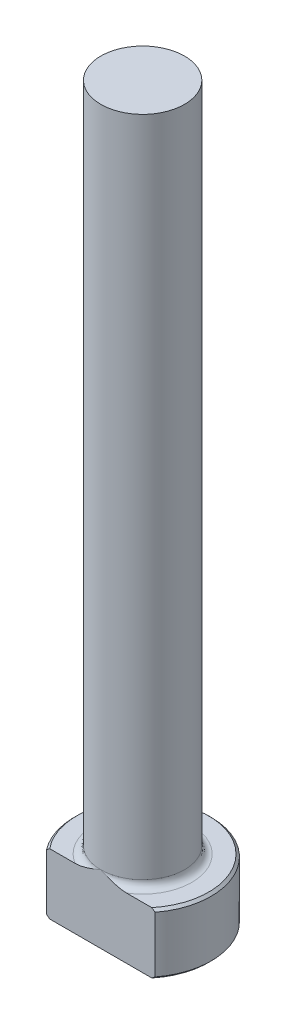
from build123d import *

# Parameters (mm, degrees)
CHAMFER1_SIZE = 0.254
FILLET1_R     = 0.762
KEY_DEPTH     = 77.865629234


with BuildPart() as part:
    # Sketch1 → Revolve1 (revolve)
    with BuildSketch(Plane.XY, mode=Mode.PRIVATE) as revolve1_sk:
        Polygon((0, 0), (-7.1374, 0), (-7.1374, 6.35), (-4.36499, 6.35), (-4.36499, 76.2), (0, 76.2), align=None)
    revolve(revolve1_sk.sketch.rotate(Axis((0, 259.958771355, 0), (0, -1, 0)), 270), axis=Axis((0, 259.958771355, 0), (0, -1, 0)))

    # Chamfer1
    chamfer1_edges = [part.edges().sort_by_distance(p)[0] for p in [
        (0, 6.35, -7.1374),
        (0, 0, -7.1374),
    ]]
    chamfer(chamfer1_edges, length=CHAMFER1_SIZE)

    # Fillet1
    fillet1_edges = [part.edges().sort_by_distance(p)[0] for p in [
        (0, 6.35, -4.36499),
    ]]
    fillet(fillet1_edges, radius=FILLET1_R)

    # Sketch2 → Key (cut, through all)
    with BuildSketch(Plane(origin=(0, 0, 0), x_dir=(1, 0, 0), z_dir=(0, 1, 0))):
        with BuildLine():
            Line((-5.647064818, -4.36499), (5.647064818, -4.36499))
            ThreePointArc((5.647064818, -4.36499), (0, -7.1374), (-5.647064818, -4.36499))
        make_face()
    extrude(amount=KEY_DEPTH, mode=Mode.SUBTRACT)


solid = part.part
